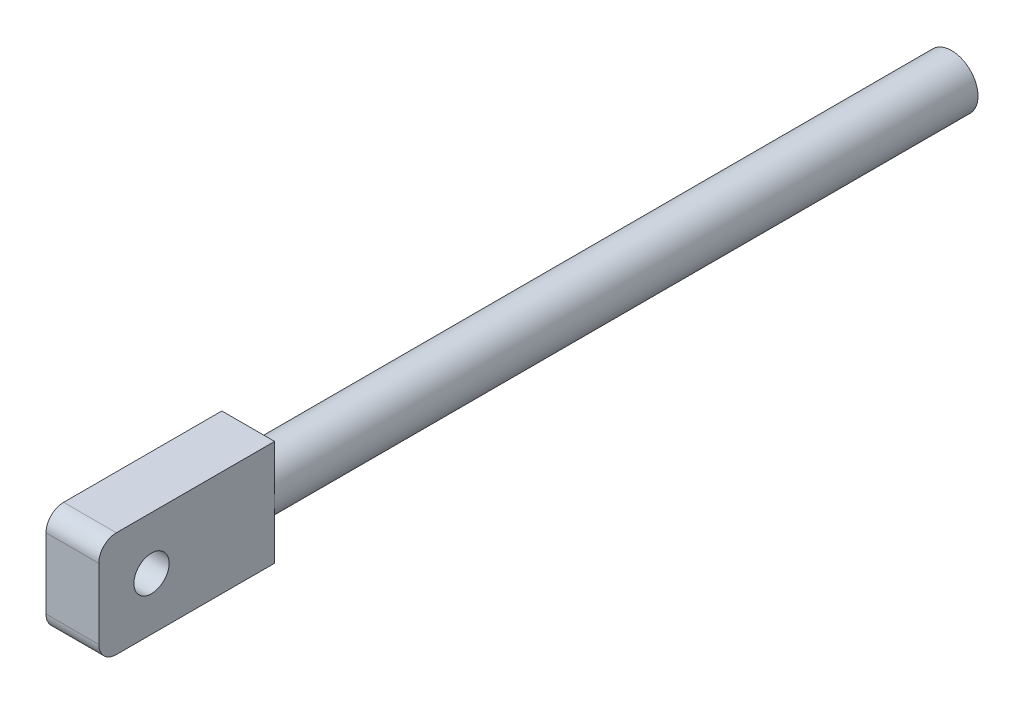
ISO-10303-21;
HEADER;
FILE_DESCRIPTION(('STEP AP214'),'2;1');
FILE_NAME('part.step','',(''),(''),'','','');
FILE_SCHEMA(('AUTOMOTIVE_DESIGN { 1 0 10303 214 1 1 1 1 }'));
ENDSEC;
DATA;
#1=APPLICATION_CONTEXT('core data for automotive mechanical design processes');
#2=APPLICATION_PROTOCOL_DEFINITION('international standard','automotive_design',2000,#1);
#3=PRODUCT_CONTEXT('',#1,'mechanical');
#4=PRODUCT('Part','Part','',(#3));
#5=PRODUCT_RELATED_PRODUCT_CATEGORY('part','',(#4));
#6=PRODUCT_DEFINITION_FORMATION('','',#4);
#7=PRODUCT_DEFINITION_CONTEXT('part definition',#1,'design');
#8=PRODUCT_DEFINITION('design','',#6,#7);
#9=PRODUCT_DEFINITION_SHAPE('','',#8);
#10=(LENGTH_UNIT() NAMED_UNIT(*) SI_UNIT(.MILLI.,.METRE.));
#11=(NAMED_UNIT(*) PLANE_ANGLE_UNIT() SI_UNIT($,.RADIAN.));
#12=(NAMED_UNIT(*) SI_UNIT($,.STERADIAN.) SOLID_ANGLE_UNIT());
#13=UNCERTAINTY_MEASURE_WITH_UNIT(LENGTH_MEASURE(1.E-05),#10,'distance_accuracy_value','');
#14=(GEOMETRIC_REPRESENTATION_CONTEXT(3) GLOBAL_UNCERTAINTY_ASSIGNED_CONTEXT((#13)) GLOBAL_UNIT_ASSIGNED_CONTEXT((#10,
#11,#12)) REPRESENTATION_CONTEXT('',''));
#15=CARTESIAN_POINT('',(0.,0.,0.));
#16=DIRECTION('',(0.,0.,1.));
#17=DIRECTION('',(1.,0.,0.));
#18=AXIS2_PLACEMENT_3D('',#15,#16,#17);
#19=CARTESIAN_POINT('',(0.,0.,400.));
#20=DIRECTION('',(0.,0.,-1.));
#21=DIRECTION('',(-1.,0.,0.));
#22=AXIS2_PLACEMENT_3D('',#19,#20,#21);
#23=CYLINDRICAL_SURFACE('',#22,15.);
#24=CARTESIAN_POINT('',(0.,0.,400.));
#25=DIRECTION('',(0.,0.,1.));
#26=DIRECTION('',(1.,0.,0.));
#27=AXIS2_PLACEMENT_3D('',#24,#25,#26);
#28=CIRCLE('',#27,15.);
#29=CARTESIAN_POINT('',(15.,0.,400.));
#30=VERTEX_POINT('',#29);
#31=CARTESIAN_POINT('',(-15.,0.,400.));
#32=VERTEX_POINT('',#31);
#33=EDGE_CURVE('E129',#30,#32,#28,.T.);
#34=ORIENTED_EDGE('',*,*,#33,.F.);
#35=EDGE_CURVE('E133',#32,#30,#28,.T.);
#36=ORIENTED_EDGE('',*,*,#35,.F.);
#37=EDGE_LOOP('',(#34,#36));
#38=FACE_BOUND('',#37,.T.);
#39=CARTESIAN_POINT('',(0.,0.,0.));
#40=DIRECTION('',(0.,0.,1.));
#41=DIRECTION('',(1.,0.,0.));
#42=AXIS2_PLACEMENT_3D('',#39,#40,#41);
#43=CIRCLE('',#42,15.);
#44=CARTESIAN_POINT('',(15.,0.,0.));
#45=VERTEX_POINT('',#44);
#46=EDGE_CURVE('E97',#45,#45,#43,.T.);
#47=ORIENTED_EDGE('',*,*,#46,.T.);
#48=EDGE_LOOP('',(#47));
#49=FACE_BOUND('',#48,.T.);
#50=ADVANCED_FACE('F33',(#38,#49),#23,.T.);
#51=CARTESIAN_POINT('',(0.,0.,0.));
#52=DIRECTION('',(0.,0.,1.));
#53=DIRECTION('',(1.,0.,0.));
#54=AXIS2_PLACEMENT_3D('',#51,#52,#53);
#55=PLANE('',#54);
#56=ORIENTED_EDGE('',*,*,#46,.F.);
#57=EDGE_LOOP('',(#56));
#58=FACE_BOUND('',#57,.T.);
#59=ADVANCED_FACE('F181',(#58),#55,.F.);
#60=CARTESIAN_POINT('',(0.,0.,400.));
#61=DIRECTION('',(0.,0.,1.));
#62=DIRECTION('',(1.,0.,0.));
#63=AXIS2_PLACEMENT_3D('',#60,#61,#62);
#64=PLANE('',#63);
#65=DIRECTION('',(0.,1.,0.));
#66=VECTOR('',#65,1.);
#67=CARTESIAN_POINT('',(15.,30.,400.));
#68=LINE('',#67,#66);
#69=CARTESIAN_POINT('',(15.,30.,400.));
#70=VERTEX_POINT('',#69);
#71=EDGE_CURVE('E113',#30,#70,#68,.T.);
#72=ORIENTED_EDGE('',*,*,#71,.F.);
#73=ORIENTED_EDGE('',*,*,#33,.T.);
#74=DIRECTION('',(0.,-1.,0.));
#75=VECTOR('',#74,1.);
#76=CARTESIAN_POINT('',(-15.,30.,400.));
#77=LINE('',#76,#75);
#78=CARTESIAN_POINT('',(-15.,30.,400.));
#79=VERTEX_POINT('',#78);
#80=EDGE_CURVE('E105',#79,#32,#77,.T.);
#81=ORIENTED_EDGE('',*,*,#80,.F.);
#82=DIRECTION('',(-1.,0.,0.));
#83=VECTOR('',#82,1.);
#84=CARTESIAN_POINT('',(-15.,30.,400.));
#85=LINE('',#84,#83);
#86=EDGE_CURVE('E119',#70,#79,#85,.T.);
#87=ORIENTED_EDGE('',*,*,#86,.F.);
#88=EDGE_LOOP('',(#72,#73,#81,#87));
#89=FACE_BOUND('',#88,.T.);
#90=ADVANCED_FACE('F187',(#89),#64,.F.);
#91=CARTESIAN_POINT('',(-15.,-30.,400.));
#92=VERTEX_POINT('',#91);
#93=EDGE_CURVE('E102',#32,#92,#77,.T.);
#94=ORIENTED_EDGE('',*,*,#93,.F.);
#95=ORIENTED_EDGE('',*,*,#35,.T.);
#96=CARTESIAN_POINT('',(15.,-30.,400.));
#97=VERTEX_POINT('',#96);
#98=EDGE_CURVE('E112',#97,#30,#68,.T.);
#99=ORIENTED_EDGE('',*,*,#98,.F.);
#100=DIRECTION('',(1.,0.,0.));
#101=VECTOR('',#100,1.);
#102=CARTESIAN_POINT('',(-15.,-30.,400.));
#103=LINE('',#102,#101);
#104=EDGE_CURVE('E94',#92,#97,#103,.T.);
#105=ORIENTED_EDGE('',*,*,#104,.F.);
#106=EDGE_LOOP('',(#94,#95,#99,#105));
#107=FACE_BOUND('',#106,.T.);
#108=ADVANCED_FACE('F110',(#107),#64,.F.);
#109=CARTESIAN_POINT('',(-15.,30.,500.));
#110=DIRECTION('',(1.,0.,0.));
#111=DIRECTION('',(0.,1.,0.));
#112=AXIS2_PLACEMENT_3D('',#109,#110,#111);
#113=PLANE('',#112);
#114=CARTESIAN_POINT('',(-15.,0.,470.));
#115=DIRECTION('',(1.,0.,0.));
#116=DIRECTION('',(0.,1.,0.));
#117=AXIS2_PLACEMENT_3D('',#114,#115,#116);
#118=CIRCLE('',#117,9.99999999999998);
#119=CARTESIAN_POINT('',(-15.,9.99999999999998,470.));
#120=VERTEX_POINT('',#119);
#121=EDGE_CURVE('E108',#120,#120,#118,.T.);
#122=ORIENTED_EDGE('',*,*,#121,.T.);
#123=EDGE_LOOP('',(#122));
#124=FACE_BOUND('',#123,.T.);
#125=DIRECTION('',(0.,0.,-1.));
#126=VECTOR('',#125,1.);
#127=CARTESIAN_POINT('',(-15.,-30.,500.));
#128=LINE('',#127,#126);
#129=CARTESIAN_POINT('',(-15.,-30.,490.));
#130=VERTEX_POINT('',#129);
#131=EDGE_CURVE('E90',#130,#92,#128,.T.);
#132=ORIENTED_EDGE('',*,*,#131,.F.);
#133=CARTESIAN_POINT('',(-15.,-20.,490.));
#134=DIRECTION('',(1.,0.,0.));
#135=DIRECTION('',(0.,1.,0.));
#136=AXIS2_PLACEMENT_3D('',#133,#134,#135);
#137=CIRCLE('',#136,10.);
#138=CARTESIAN_POINT('',(-15.,-20.,500.));
#139=VERTEX_POINT('',#138);
#140=EDGE_CURVE('E41',#130,#139,#137,.F.);
#141=ORIENTED_EDGE('',*,*,#140,.T.);
#142=DIRECTION('',(0.,-1.,0.));
#143=VECTOR('',#142,1.);
#144=CARTESIAN_POINT('',(-15.,30.,500.));
#145=LINE('',#144,#143);
#146=CARTESIAN_POINT('',(-15.,20.,500.));
#147=VERTEX_POINT('',#146);
#148=EDGE_CURVE('E122',#147,#139,#145,.T.);
#149=ORIENTED_EDGE('',*,*,#148,.F.);
#150=CARTESIAN_POINT('',(-15.,20.,490.));
#151=DIRECTION('',(1.,0.,0.));
#152=DIRECTION('',(0.,1.,0.));
#153=AXIS2_PLACEMENT_3D('',#150,#151,#152);
#154=CIRCLE('',#153,10.);
#155=CARTESIAN_POINT('',(-15.,30.,490.));
#156=VERTEX_POINT('',#155);
#157=EDGE_CURVE('E48',#147,#156,#154,.F.);
#158=ORIENTED_EDGE('',*,*,#157,.T.);
#159=DIRECTION('',(0.,0.,-1.));
#160=VECTOR('',#159,1.);
#161=CARTESIAN_POINT('',(-15.,30.,500.));
#162=LINE('',#161,#160);
#163=EDGE_CURVE('E123',#156,#79,#162,.T.);
#164=ORIENTED_EDGE('',*,*,#163,.T.);
#165=ORIENTED_EDGE('',*,*,#80,.T.);
#166=ORIENTED_EDGE('',*,*,#93,.T.);
#167=EDGE_LOOP('',(#132,#141,#149,#158,#164,#165,#166));
#168=FACE_BOUND('',#167,.T.);
#169=ADVANCED_FACE('F103',(#124,#168),#113,.F.);
#170=CARTESIAN_POINT('',(-15.,-30.,500.));
#171=DIRECTION('',(0.,1.,0.));
#172=DIRECTION('',(-1.,0.,0.));
#173=AXIS2_PLACEMENT_3D('',#170,#171,#172);
#174=PLANE('',#173);
#175=DIRECTION('',(0.,0.,-1.));
#176=VECTOR('',#175,1.);
#177=CARTESIAN_POINT('',(15.,-30.,500.));
#178=LINE('',#177,#176);
#179=CARTESIAN_POINT('',(15.,-30.,490.));
#180=VERTEX_POINT('',#179);
#181=EDGE_CURVE('E98',#180,#97,#178,.T.);
#182=ORIENTED_EDGE('',*,*,#181,.F.);
#183=DIRECTION('',(1.,0.,0.));
#184=VECTOR('',#183,1.);
#185=CARTESIAN_POINT('',(-15.,-30.,490.));
#186=LINE('',#185,#184);
#187=EDGE_CURVE('E56',#180,#130,#186,.F.);
#188=ORIENTED_EDGE('',*,*,#187,.T.);
#189=ORIENTED_EDGE('',*,*,#131,.T.);
#190=ORIENTED_EDGE('',*,*,#104,.T.);
#191=EDGE_LOOP('',(#182,#188,#189,#190));
#192=FACE_BOUND('',#191,.T.);
#193=ADVANCED_FACE('F92',(#192),#174,.F.);
#194=CARTESIAN_POINT('',(15.,30.,500.));
#195=DIRECTION('',(-1.,0.,0.));
#196=DIRECTION('',(0.,-1.,0.));
#197=AXIS2_PLACEMENT_3D('',#194,#195,#196);
#198=PLANE('',#197);
#199=CARTESIAN_POINT('',(15.,0.,470.));
#200=DIRECTION('',(1.,0.,0.));
#201=DIRECTION('',(0.,1.,0.));
#202=AXIS2_PLACEMENT_3D('',#199,#200,#201);
#203=CIRCLE('',#202,9.99999999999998);
#204=CARTESIAN_POINT('',(15.,9.99999999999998,470.));
#205=VERTEX_POINT('',#204);
#206=EDGE_CURVE('E163',#205,#205,#203,.T.);
#207=ORIENTED_EDGE('',*,*,#206,.F.);
#208=EDGE_LOOP('',(#207));
#209=FACE_BOUND('',#208,.T.);
#210=DIRECTION('',(0.,1.,0.));
#211=VECTOR('',#210,1.);
#212=CARTESIAN_POINT('',(15.,30.,500.));
#213=LINE('',#212,#211);
#214=CARTESIAN_POINT('',(15.,-20.,500.));
#215=VERTEX_POINT('',#214);
#216=CARTESIAN_POINT('',(15.,20.,500.));
#217=VERTEX_POINT('',#216);
#218=EDGE_CURVE('E126',#215,#217,#213,.T.);
#219=ORIENTED_EDGE('',*,*,#218,.F.);
#220=CARTESIAN_POINT('',(15.,-20.,490.));
#221=DIRECTION('',(-1.,0.,0.));
#222=DIRECTION('',(0.,-1.,0.));
#223=AXIS2_PLACEMENT_3D('',#220,#221,#222);
#224=CIRCLE('',#223,10.);
#225=EDGE_CURVE('E143',#215,#180,#224,.F.);
#226=ORIENTED_EDGE('',*,*,#225,.T.);
#227=ORIENTED_EDGE('',*,*,#181,.T.);
#228=ORIENTED_EDGE('',*,*,#98,.T.);
#229=ORIENTED_EDGE('',*,*,#71,.T.);
#230=DIRECTION('',(0.,0.,-1.));
#231=VECTOR('',#230,1.);
#232=CARTESIAN_POINT('',(15.,30.,500.));
#233=LINE('',#232,#231);
#234=CARTESIAN_POINT('',(15.,30.,490.));
#235=VERTEX_POINT('',#234);
#236=EDGE_CURVE('E125',#235,#70,#233,.T.);
#237=ORIENTED_EDGE('',*,*,#236,.F.);
#238=CARTESIAN_POINT('',(15.,20.,490.));
#239=DIRECTION('',(-1.,0.,0.));
#240=DIRECTION('',(0.,-1.,0.));
#241=AXIS2_PLACEMENT_3D('',#238,#239,#240);
#242=CIRCLE('',#241,10.);
#243=EDGE_CURVE('E141',#235,#217,#242,.F.);
#244=ORIENTED_EDGE('',*,*,#243,.T.);
#245=EDGE_LOOP('',(#219,#226,#227,#228,#229,#237,#244));
#246=FACE_BOUND('',#245,.T.);
#247=ADVANCED_FACE('F157',(#209,#246),#198,.F.);
#248=CARTESIAN_POINT('',(-15.,30.,500.));
#249=DIRECTION('',(0.,-1.,0.));
#250=DIRECTION('',(0.,0.,-1.));
#251=AXIS2_PLACEMENT_3D('',#248,#249,#250);
#252=PLANE('',#251);
#253=ORIENTED_EDGE('',*,*,#163,.F.);
#254=DIRECTION('',(-1.,0.,0.));
#255=VECTOR('',#254,1.);
#256=CARTESIAN_POINT('',(15.,30.,490.));
#257=LINE('',#256,#255);
#258=EDGE_CURVE('E11',#156,#235,#257,.F.);
#259=ORIENTED_EDGE('',*,*,#258,.T.);
#260=ORIENTED_EDGE('',*,*,#236,.T.);
#261=ORIENTED_EDGE('',*,*,#86,.T.);
#262=EDGE_LOOP('',(#253,#259,#260,#261));
#263=FACE_BOUND('',#262,.T.);
#264=ADVANCED_FACE('F171',(#263),#252,.F.);
#265=CARTESIAN_POINT('',(0.,0.,500.));
#266=DIRECTION('',(0.,0.,1.));
#267=DIRECTION('',(1.,0.,0.));
#268=AXIS2_PLACEMENT_3D('',#265,#266,#267);
#269=PLANE('',#268);
#270=ORIENTED_EDGE('',*,*,#148,.T.);
#271=DIRECTION('',(1.,0.,0.));
#272=VECTOR('',#271,1.);
#273=CARTESIAN_POINT('',(15.,-20.,500.));
#274=LINE('',#273,#272);
#275=EDGE_CURVE('E138',#139,#215,#274,.T.);
#276=ORIENTED_EDGE('',*,*,#275,.T.);
#277=ORIENTED_EDGE('',*,*,#218,.T.);
#278=DIRECTION('',(-1.,0.,0.));
#279=VECTOR('',#278,1.);
#280=CARTESIAN_POINT('',(-15.,20.,500.));
#281=LINE('',#280,#279);
#282=EDGE_CURVE('E132',#217,#147,#281,.T.);
#283=ORIENTED_EDGE('',*,*,#282,.T.);
#284=EDGE_LOOP('',(#270,#276,#277,#283));
#285=FACE_BOUND('',#284,.T.);
#286=ADVANCED_FACE('F150',(#285),#269,.T.);
#287=CARTESIAN_POINT('',(0.,-20.,490.));
#288=DIRECTION('',(-1.,0.,0.));
#289=DIRECTION('',(0.,-1.,0.));
#290=AXIS2_PLACEMENT_3D('',#287,#288,#289);
#291=CYLINDRICAL_SURFACE('',#290,10.);
#292=ORIENTED_EDGE('',*,*,#140,.F.);
#293=ORIENTED_EDGE('',*,*,#187,.F.);
#294=ORIENTED_EDGE('',*,*,#225,.F.);
#295=ORIENTED_EDGE('',*,*,#275,.F.);
#296=EDGE_LOOP('',(#292,#293,#294,#295));
#297=FACE_BOUND('',#296,.T.);
#298=ADVANCED_FACE('F155',(#297),#291,.T.);
#299=CARTESIAN_POINT('',(0.,20.,490.));
#300=DIRECTION('',(1.,0.,0.));
#301=DIRECTION('',(0.,0.,-1.));
#302=AXIS2_PLACEMENT_3D('',#299,#300,#301);
#303=CYLINDRICAL_SURFACE('',#302,10.);
#304=ORIENTED_EDGE('',*,*,#243,.F.);
#305=ORIENTED_EDGE('',*,*,#258,.F.);
#306=ORIENTED_EDGE('',*,*,#157,.F.);
#307=ORIENTED_EDGE('',*,*,#282,.F.);
#308=EDGE_LOOP('',(#304,#305,#306,#307));
#309=FACE_BOUND('',#308,.T.);
#310=ADVANCED_FACE('F35',(#309),#303,.T.);
#311=CARTESIAN_POINT('',(-85.,0.,470.));
#312=DIRECTION('',(1.,0.,0.));
#313=DIRECTION('',(0.,1.,0.));
#314=AXIS2_PLACEMENT_3D('',#311,#312,#313);
#315=CYLINDRICAL_SURFACE('',#314,9.99999999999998);
#316=ORIENTED_EDGE('',*,*,#206,.T.);
#317=EDGE_LOOP('',(#316));
#318=FACE_BOUND('',#317,.T.);
#319=ORIENTED_EDGE('',*,*,#121,.F.);
#320=EDGE_LOOP('',(#319));
#321=FACE_BOUND('',#320,.T.);
#322=ADVANCED_FACE('F167',(#318,#321),#315,.F.);
#323=CLOSED_SHELL('',(#50,#59,#90,#108,#169,#193,#247,#264,#286,#298,#310,#322));
#324=MANIFOLD_SOLID_BREP('B2',#323);
#325=ADVANCED_BREP_SHAPE_REPRESENTATION('',(#18,#324),#14);
#326=SHAPE_DEFINITION_REPRESENTATION(#9,#325);
ENDSEC;
END-ISO-10303-21;
